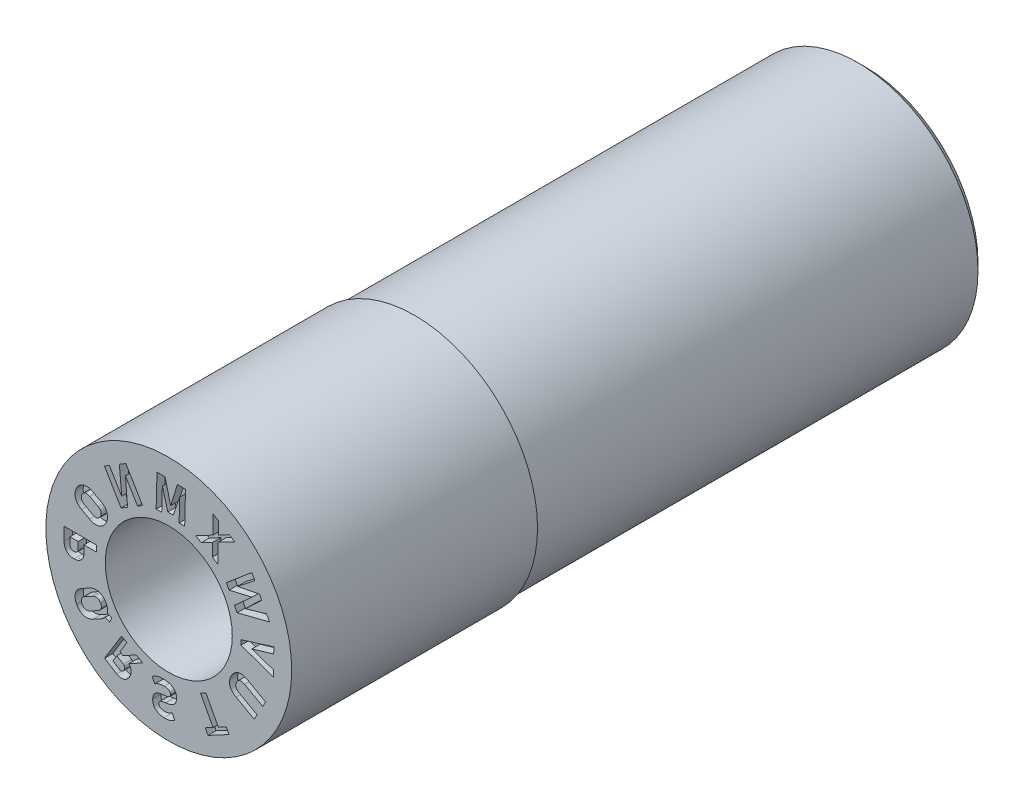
from build123d import *

# Parameters (mm, degrees)
SKETCH4_W          = 11
SKETCH4_H          = 1
CUT_EXTRUDE1_DEPTH = 0.2
CUT_EXTRUDE2_DEPTH = 1.4


with BuildPart() as part:
    # Sketch1 → Revolve1 (revolve)
    with BuildSketch(Plane(origin=(0, 0, 0), x_dir=(0, 0, -1), z_dir=(1, 0, 0)), mode=Mode.PRIVATE) as revolve1_sk:
        Polygon((0, 3), (0, 1.55), (2.8, 1.55), (2.8, 0.8), (14, 0.8), (14, 1.5), (17, 1.5), (17, 2.75), (16.75, 3), align=None)
    revolve(revolve1_sk.sketch.rotate(Axis((0, 0, 3.797909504), (0, 0, -1)), 90), axis=Axis((0, 0, 3.797909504), (0, 0, -1)))

    # Sketch4 → Cut-Revolve1 (revolve, cut)
    with BuildSketch(Plane(origin=(0, 0, 0), x_dir=(0, 0, -1), z_dir=(1, 0, 0)), mode=Mode.PRIVATE) as cut_revolve1_sk:
        with Locations((11.5, 3.435)):
            Rectangle(SKETCH4_W, SKETCH4_H)
    revolve(cut_revolve1_sk.sketch.rotate(Axis((0, 0, 0), (0, 0, -1)), 90), axis=Axis((0, 0, 0), (0, 0, -1)), mode=Mode.SUBTRACT)

    # Sketch2 → Cut-Extrude1 (cut)
    # profile 1 of 12: a face of its own
    with BuildSketch(Plane.XY):
        Polygon((2.269961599, 1.10939245), (2.215041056, 1.216013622), (1.675556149, 1.108706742), (2.099003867, 1.441434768), (2.028649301, 1.578164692), (1.407466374, 1.052778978), (1.471831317, 0.927682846), (2.028743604, 1.056310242), (1.603697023, 0.671870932), (1.668061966, 0.546774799), (2.456353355, 0.74724138), (2.385998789, 0.883971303), (1.869157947, 0.732459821), align=None)
    # profile 2 of 12: a face of its own
    with BuildSketch(Plane.XY):
        with BuildLine():
            Line((-2.068801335, 0.113277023), (-1.761023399, 0.112503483))
            Line((-1.761023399, 0.112503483), (-1.760614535, 0.262023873))
            Line((-1.760614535, 0.262023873), (-2.55380105, 0.264017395))
            Line((-2.55380105, 0.264017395), (-2.554571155, -0.054097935))
            add(Edge.make_bspline(
                [(-2.554571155, -0.054097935), (-2.554799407, -0.077504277), (-2.551376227, -0.111994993), (-2.5386526, -0.155381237), (-2.525537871, -0.184889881), (-2.508898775, -0.21170966), (-2.488986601, -0.235538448), (-2.465902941, -0.256095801), (-2.43977874, -0.273245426), (-2.411099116, -0.287077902), (-2.368647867, -0.300213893), (-2.33492501, -0.304167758), (-2.311979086, -0.303998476)],
                knots=[0, 0, 0, 0, 0.179096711, 0.263088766, 0.345010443, 0.425420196, 0.503810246, 0.581803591, 0.661047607, 0.742192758, 0.824607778, 1, 1, 1, 1], degree=3))
            add(Edge.make_bspline(
                [(-2.311979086, -0.303998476), (-2.289101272, -0.304083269), (-2.255348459, -0.300608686), (-2.213031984, -0.28744471), (-2.184417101, -0.273757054), (-2.158294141, -0.256842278), (-2.135270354, -0.23633847), (-2.115457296, -0.212606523), (-2.098753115, -0.185976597), (-2.085684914, -0.156582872), (-2.072494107, -0.113362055), (-2.069316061, -0.078782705), (-2.069154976, -0.055383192)],
                knots=[0, 0, 0, 0, 0.175511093, 0.257971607, 0.338737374, 0.418047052, 0.495878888, 0.574236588, 0.654395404, 0.736169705, 0.820238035, 1, 1, 1, 1], degree=3))
            Line((-2.069154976, -0.055383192), (-2.068801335, 0.113277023))
        make_face()
        with BuildLine():
            Line((-2.2128306, 0.113639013), (-2.213201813, -0.058724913))
            add(Edge.make_bspline(
                [(-2.213201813, -0.058724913), (-2.21323881, -0.067221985), (-2.214832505, -0.079706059), (-2.219846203, -0.095430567), (-2.225421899, -0.105948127), (-2.232025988, -0.115738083), (-2.240280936, -0.124222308), (-2.249625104, -0.131737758), (-2.260269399, -0.137923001), (-2.271804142, -0.143064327), (-2.288913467, -0.147749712), (-2.302348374, -0.149206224), (-2.311538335, -0.149143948)],
                knots=[0, 0, 0, 0, 0.169701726, 0.250141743, 0.328711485, 0.407036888, 0.485569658, 0.564515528, 0.646216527, 0.731138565, 0.816415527, 1, 1, 1, 1], degree=3))
            add(Edge.make_bspline(
                [(-2.311538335, -0.149143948), (-2.320849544, -0.149099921), (-2.334611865, -0.14788996), (-2.35187834, -0.142852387), (-2.363674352, -0.138004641), (-2.374343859, -0.131782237), (-2.383847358, -0.124354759), (-2.392016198, -0.115754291), (-2.398888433, -0.106050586), (-2.404099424, -0.09528711), (-2.409401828, -0.079493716), (-2.410521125, -0.066755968), (-2.410568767, -0.058191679)],
                knots=[0, 0, 0, 0, 0.184774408, 0.271287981, 0.355539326, 0.436837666, 0.515202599, 0.593720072, 0.671030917, 0.749801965, 0.829807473, 1, 1, 1, 1], degree=3))
            Line((-2.410568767, -0.058191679), (-2.410197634, 0.114135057))
            Line((-2.410197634, 0.114135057), (-2.2128306, 0.113639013))
        make_face(mode=Mode.SUBTRACT)
    # profile 3 of 12: a face of its own
    with BuildSketch(Plane.XY):
        Polygon((1.207581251, 1.806957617), (1.608315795, 2.016807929), (1.474297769, 2.099805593), (1.211357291, 1.962072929), (1.218694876, 2.257920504), (1.084315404, 2.340918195), (1.073431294, 1.889679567), (0.656387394, 1.671768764), (0.790766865, 1.588771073), (1.069684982, 1.734985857), (1.062055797, 1.420968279), (1.196290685, 1.337898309), align=None)
    # profile 4 of 12: a face of its own
    with BuildSketch(Plane.XY):
        with BuildLine():
            Line((-1.114677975, -1.753191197), (-1.191880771, -1.705847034))
            Line((-1.191880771, -1.705847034), (-1.024950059, -1.433715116))
            Line((-1.024950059, -1.433715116), (-1.152463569, -1.355543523))
            Line((-1.152463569, -1.355543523), (-1.56754191, -2.032207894))
            Line((-1.56754191, -2.032207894), (-1.27138768, -2.213917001))
            add(Edge.make_bspline(
                [(-1.27138768, -2.213917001), (-1.253710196, -2.224551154), (-1.225992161, -2.237968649), (-1.18683794, -2.247098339), (-1.157941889, -2.249889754), (-1.129355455, -2.248236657), (-1.101352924, -2.242568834), (-1.074305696, -2.232544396), (-1.048154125, -2.218737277), (-1.023356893, -2.201050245), (-0.991940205, -2.171714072), (-0.971931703, -2.145520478), (-0.960367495, -2.126408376)],
                knots=[0, 0, 0, 0, 0.170511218, 0.251263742, 0.330554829, 0.409169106, 0.48658696, 0.565366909, 0.646269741, 0.729870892, 0.815831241, 1, 1, 1, 1], degree=3))
            add(Edge.make_bspline(
                [(-0.960367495, -2.126408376), (-0.948791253, -2.107317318), (-0.933942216, -2.077749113), (-0.922389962, -2.036290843), (-0.917689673, -2.006139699), (-0.917313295, -1.976562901), (-0.920678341, -1.947843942), (-0.928492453, -1.920364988), (-0.940164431, -1.894130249), (-0.955174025, -1.870107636), (-0.967192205, -1.855661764), (-0.973414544, -1.849077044)],
                knots=[0, 0, 0, 0, 0.184350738, 0.270499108, 0.353948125, 0.4352156, 0.51362466, 0.591508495, 0.669792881, 0.749624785, 0.824262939, 0.824262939, 0.824262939, 0.824262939], degree=3))
            Line((-0.973414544, -1.849077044), (-0.640884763, -1.669450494))
            Line((-0.640884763, -1.669450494), (-0.795308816, -1.574654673))
            Line((-0.795308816, -1.574654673), (-1.114677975, -1.753191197))
        make_face()
        with BuildLine():
            Line((-1.267207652, -1.828645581), (-1.108791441, -1.925819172))
            add(Edge.make_bspline(
                [(-1.108791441, -1.925819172), (-1.102451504, -1.929449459), (-1.094054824, -1.936425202), (-1.08513243, -1.947600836), (-1.079953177, -1.956719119), (-1.076316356, -1.96647343), (-1.074040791, -1.976799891), (-1.073260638, -1.987657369), (-1.074149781, -1.999004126), (-1.076405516, -2.0105738), (-1.081390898, -2.026691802), (-1.087007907, -2.03836603), (-1.091580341, -2.045943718)],
                knots=[0, 0, 0, 0, 0.160363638, 0.237859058, 0.313886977, 0.390284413, 0.466266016, 0.546044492, 0.62907491, 0.716185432, 0.805143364, 1, 1, 1, 1], degree=3))
            add(Edge.make_bspline(
                [(-1.091580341, -2.045943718), (-1.096019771, -2.053479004), (-1.10378041, -2.063752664), (-1.11567825, -2.075588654), (-1.124936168, -2.082892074), (-1.13476272, -2.088498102), (-1.144651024, -2.092990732), (-1.154931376, -2.095476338), (-1.165274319, -2.096850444), (-1.175718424, -2.096219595), (-1.189915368, -2.093465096), (-1.199967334, -2.088756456), (-1.206308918, -2.084884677)],
                knots=[0, 0, 0, 0, 0.192245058, 0.281876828, 0.368857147, 0.450818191, 0.530411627, 0.606942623, 0.682725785, 0.75921083, 0.83607186, 1, 1, 1, 1], degree=3))
            Line((-1.206308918, -2.084884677), (-1.36476598, -1.987686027))
            Line((-1.36476598, -1.987686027), (-1.267207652, -1.828645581))
        make_face(mode=Mode.SUBTRACT)
    # profile 5 of 12: a face of its own
    with BuildSketch(Plane.XY):
        Polygon((-0.090645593, 2.53873645), (-0.28768482, 2.543906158), (-0.307976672, 1.750711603), (-0.172032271, 1.747243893), (-0.157578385, 2.310016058), (-0.023604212, 1.83182966), (0.108457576, 1.82840083), (0.266656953, 2.289668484), (0.252444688, 1.736303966), (0.388227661, 1.732844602), (0.408519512, 2.526039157), (0.211633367, 2.531039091), (0.046780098, 2.000408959), align=None)
    # profile 6 of 12: a face of its own
    with BuildSketch(Plane.XY):
        Polygon((1.08056531, -2.171597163), (0.889853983, -2.273408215), (0.95768341, -2.400516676), (1.470726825, -2.126628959), (1.402897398, -1.999520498), (1.212317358, -2.101261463), (0.906596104, -1.528426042), (0.774878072, -1.598825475), align=None)
    # profile 7 of 12: a face of its own
    with BuildSketch(Plane.XY):
        Polygon((-1.047955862, 2.342137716), (-1.205453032, 2.247994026), (-1.149521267, 1.602781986), (-1.448465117, 2.102888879), (-1.571666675, 2.029228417), (-1.163505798, 1.346324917), (-1.004980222, 1.441017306), (-1.057558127, 2.078702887), (-0.762920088, 1.585716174), (-0.639794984, 1.659234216), align=None)
    # profile 8 of 12: a face of its own
    with BuildSketch(Plane.XY):
        with BuildLine():
            Line((-1.653695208, 1.23468154), (-1.851264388, 1.343041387))
            add(Edge.make_bspline(
                [(-1.851264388, 1.343041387), (-1.863764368, 1.349704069), (-1.88253424, 1.359242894), (-1.908468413, 1.368762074), (-1.927521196, 1.374815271), (-1.946593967, 1.37945218), (-1.965628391, 1.382909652), (-1.984631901, 1.384749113), (-2.003520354, 1.385660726), (-2.022200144, 1.384827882), (-2.040593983, 1.383308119), (-2.058578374, 1.379968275), (-2.076215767, 1.375618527), (-2.093524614, 1.370015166), (-2.110347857, 1.362994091), (-2.12695135, 1.355014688), (-2.142978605, 1.345458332), (-2.158432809, 1.334764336), (-2.173463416, 1.323145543), (-2.187599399, 1.310190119), (-2.201132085, 1.296171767), (-2.213948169, 1.281043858), (-2.23031128, 1.25915329), (-2.241210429, 1.241488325), (-2.247934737, 1.229228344)],
                knots=[0, 0, 0, 0, 0.091509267, 0.135459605, 0.178154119, 0.220454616, 0.262041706, 0.302877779, 0.343583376, 0.383954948, 0.42345463, 0.462585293, 0.501839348, 0.540633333, 0.579850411, 0.619400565, 0.659411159, 0.700116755, 0.740631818, 0.781903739, 0.823734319, 0.866298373, 0.909761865, 1, 1, 1, 1], degree=3))
            add(Edge.make_bspline(
                [(-2.247934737, 1.229228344), (-2.254779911, 1.216989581), (-2.263710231, 1.198219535), (-2.273362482, 1.172634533), (-2.279121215, 1.153694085), (-2.283893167, 1.134844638), (-2.286878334, 1.115881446), (-2.288893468, 1.097001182), (-2.289497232, 1.078134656), (-2.288907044, 1.059471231), (-2.286737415, 1.04114284), (-2.283607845, 1.023203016), (-2.279119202, 1.005619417), (-2.273315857, 0.988419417), (-2.266151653, 0.971633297), (-2.258026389, 0.955054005), (-2.248222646, 0.93913159), (-2.237630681, 0.923455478), (-2.225487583, 0.908692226), (-2.212604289, 0.894251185), (-2.198259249, 0.880807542), (-2.183113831, 0.867731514), (-2.160828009, 0.851361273), (-2.14293173, 0.840362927), (-2.130515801, 0.833519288)],
                knots=[0, 0, 0, 0, 0.090427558, 0.133878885, 0.176295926, 0.218093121, 0.259200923, 0.300025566, 0.340521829, 0.380882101, 0.420369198, 0.459488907, 0.49829228, 0.537326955, 0.57647291, 0.615973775, 0.656310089, 0.697004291, 0.737925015, 0.779528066, 0.821766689, 0.864651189, 0.908550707, 1, 1, 1, 1], degree=3))
            Line((-2.130515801, 0.833519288), (-1.93294662, 0.725159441))
            add(Edge.make_bspline(
                [(-1.93294662, 0.725159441), (-1.9204413, 0.718514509), (-1.901687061, 0.708923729), (-1.875689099, 0.699473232), (-1.856700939, 0.693196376), (-1.837566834, 0.688783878), (-1.818510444, 0.685284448), (-1.799430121, 0.683372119), (-1.780491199, 0.682600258), (-1.761782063, 0.682929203), (-1.743412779, 0.684990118), (-1.725387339, 0.687975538), (-1.707714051, 0.692323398), (-1.690436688, 0.698008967), (-1.673531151, 0.70496292), (-1.657009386, 0.713217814), (-1.640911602, 0.722737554), (-1.62542025, 0.733477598), (-1.610387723, 0.745092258), (-1.596252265, 0.75804881), (-1.582719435, 0.772066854), (-1.569903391, 0.787194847), (-1.553540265, 0.809085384), (-1.542641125, 0.826750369), (-1.535916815, 0.839010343)],
                knots=[0, 0, 0, 0, 0.091418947, 0.135325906, 0.178244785, 0.220252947, 0.261798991, 0.30308282, 0.34374824, 0.383960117, 0.423573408, 0.462799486, 0.501685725, 0.540777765, 0.579956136, 0.619429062, 0.659747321, 0.700412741, 0.740887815, 0.782119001, 0.823908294, 0.866430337, 0.90985093, 1, 1, 1, 1], degree=3))
            add(Edge.make_bspline(
                [(-1.535916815, 0.839010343), (-1.529077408, 0.851250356), (-1.520130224, 0.870016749), (-1.510504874, 0.895607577), (-1.504684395, 0.91449499), (-1.500176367, 0.933398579), (-1.49688001, 0.95227427), (-1.49516187, 0.971190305), (-1.494441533, 0.989943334), (-1.495209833, 1.008550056), (-1.4971247, 1.026848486), (-1.500229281, 1.044867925), (-1.505115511, 1.06239099), (-1.510613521, 1.079732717), (-1.517801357, 1.096595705), (-1.526281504, 1.113036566), (-1.535723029, 1.129240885), (-1.546699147, 1.144648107), (-1.558489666, 1.159695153), (-1.571661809, 1.173889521), (-1.585934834, 1.187408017), (-1.601101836, 1.20046526), (-1.623379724, 1.216842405), (-1.641280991, 1.22783641), (-1.653695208, 1.23468154)],
                knots=[0, 0, 0, 0, 0.090417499, 0.133863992, 0.176276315, 0.217818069, 0.259154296, 0.299759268, 0.340251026, 0.380131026, 0.419767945, 0.458883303, 0.497905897, 0.537021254, 0.576162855, 0.615970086, 0.656312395, 0.697015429, 0.737894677, 0.779552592, 0.821786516, 0.864666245, 0.90856088, 1, 1, 1, 1], degree=3))
        make_face()
        with BuildLine():
            Line((-1.854781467, 0.859507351), (-2.059275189, 0.971499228))
            add(Edge.make_bspline(
                [(-2.059275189, 0.971499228), (-2.070822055, 0.977705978), (-2.086694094, 0.988826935), (-2.104826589, 1.006549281), (-2.115680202, 1.021049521), (-2.124660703, 1.036251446), (-2.130808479, 1.052445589), (-2.134815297, 1.069215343), (-2.136030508, 1.086575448), (-2.134943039, 1.10427525), (-2.130314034, 1.128599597), (-2.122553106, 1.14596887), (-2.116561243, 1.157219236)],
                knots=[0, 0, 0, 0, 0.179291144, 0.26398396, 0.346173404, 0.426702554, 0.505006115, 0.582502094, 0.662078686, 0.742384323, 0.824864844, 1, 1, 1, 1], degree=3))
            add(Edge.make_bspline(
                [(-2.116561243, 1.157219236), (-2.110462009, 1.168426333), (-2.099622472, 1.183926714), (-2.081883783, 1.201116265), (-2.067677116, 1.211629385), (-2.052275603, 1.219677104), (-2.036098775, 1.225449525), (-2.019063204, 1.228654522), (-2.001434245, 1.229540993), (-1.98336761, 1.228080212), (-1.958720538, 1.22221453), (-1.940731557, 1.215126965), (-1.929342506, 1.208557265)],
                knots=[0, 0, 0, 0, 0.175013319, 0.257188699, 0.337905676, 0.416521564, 0.494677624, 0.572623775, 0.653377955, 0.736149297, 0.820281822, 1, 1, 1, 1], degree=3))
            Line((-1.929342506, 1.208557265), (-1.724848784, 1.096565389))
            add(Edge.make_bspline(
                [(-1.724848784, 1.096565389), (-1.713294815, 1.090271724), (-1.697439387, 1.079148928), (-1.679255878, 1.06148279), (-1.66844602, 1.047012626), (-1.659463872, 1.031813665), (-1.653311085, 1.015619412), (-1.649342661, 0.998918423), (-1.648032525, 0.981644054), (-1.649096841, 0.963964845), (-1.654021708, 0.939713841), (-1.661383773, 0.922234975), (-1.667513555, 0.911068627)],
                knots=[0, 0, 0, 0, 0.180158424, 0.264225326, 0.346506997, 0.427126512, 0.50551794, 0.583100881, 0.661766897, 0.742162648, 0.825246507, 1, 1, 1, 1], degree=3))
            add(Edge.make_bspline(
                [(-1.667513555, 0.911068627), (-1.673918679, 0.900089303), (-1.684166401, 0.884071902), (-1.702251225, 0.867217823), (-1.716425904, 0.85660521), (-1.731895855, 0.848602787), (-1.748016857, 0.842560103), (-1.765066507, 0.839417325), (-1.782655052, 0.838552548), (-1.800731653, 0.839859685), (-1.825466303, 0.845495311), (-1.843375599, 0.852996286), (-1.854781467, 0.859507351)],
                knots=[0, 0, 0, 0, 0.17506645, 0.257026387, 0.337672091, 0.416954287, 0.4948771, 0.572754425, 0.6534373, 0.735689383, 0.820268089, 1, 1, 1, 1], degree=3))
        make_face(mode=Mode.SUBTRACT)
    # profile 9 of 12: a face of its own
    with BuildSketch(Plane.XY):
        with BuildLine():
            Line((-1.55203058, -1.159989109), (-1.442402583, -1.208864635))
            Line((-1.442402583, -1.208864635), (-1.391673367, -1.089487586))
            Line((-1.391673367, -1.089487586), (-1.49596757, -1.043145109))
            add(Edge.make_bspline(
                [(-1.49596757, -1.043145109), (-1.495153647, -1.039077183), (-1.493354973, -1.028940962), (-1.491858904, -1.012470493), (-1.491051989, -0.99378221), (-1.491767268, -0.974933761), (-1.493608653, -0.955982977), (-1.497042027, -0.937095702), (-1.501526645, -0.918114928), (-1.507319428, -0.899139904), (-1.517147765, -0.873555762), (-1.526216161, -0.854823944), (-1.532987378, -0.842518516)],
                knots=[0.55328784, 0.55328784, 0.55328784, 0.55328784, 0.579974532, 0.619519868, 0.659607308, 0.700291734, 0.740802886, 0.782043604, 0.823730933, 0.866270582, 0.90961669, 1, 1, 1, 1], degree=3))
            add(Edge.make_bspline(
                [(-1.532987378, -0.842518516), (-1.539570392, -0.830134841), (-1.550800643, -0.812645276), (-1.567018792, -0.790591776), (-1.579984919, -0.775562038), (-1.593565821, -0.761590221), (-1.607860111, -0.748726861), (-1.622846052, -0.736958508), (-1.638435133, -0.726342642), (-1.654582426, -0.716915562), (-1.671132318, -0.708710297), (-1.688081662, -0.70190745), (-1.705312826, -0.696117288), (-1.723038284, -0.69194558), (-1.741113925, -0.688601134), (-1.759610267, -0.687043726), (-1.778350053, -0.686458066), (-1.797307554, -0.686991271), (-1.816304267, -0.689367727), (-1.835437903, -0.692439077), (-1.854485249, -0.697371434), (-1.873608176, -0.703297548), (-1.899528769, -0.713054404), (-1.918265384, -0.722694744), (-1.930830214, -0.729296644)],
                knots=[0, 0, 0, 0, 0.090195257, 0.133684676, 0.176153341, 0.217890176, 0.259069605, 0.299873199, 0.340487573, 0.3804085, 0.420176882, 0.459306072, 0.497927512, 0.537093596, 0.576457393, 0.616177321, 0.656458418, 0.697161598, 0.738122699, 0.779639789, 0.821845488, 0.864668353, 0.908520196, 1, 1, 1, 1], degree=3))
            Line((-1.930830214, -0.729296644), (-2.128642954, -0.83818309))
            add(Edge.make_bspline(
                [(-2.128642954, -0.83818309), (-2.140948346, -0.845241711), (-2.159035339, -0.856007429), (-2.181172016, -0.87264176), (-2.19641723, -0.885640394), (-2.210796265, -0.899101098), (-2.223845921, -0.913501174), (-2.235815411, -0.928482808), (-2.246625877, -0.944075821), (-2.256230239, -0.960176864), (-2.264574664, -0.976695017), (-2.271615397, -0.993595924), (-2.277275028, -1.010871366), (-2.281994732, -1.028480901), (-2.285076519, -1.046524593), (-2.287078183, -1.064886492), (-2.28784204, -1.083521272), (-2.286952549, -1.102354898), (-2.285304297, -1.121319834), (-2.281867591, -1.14021956), (-2.277210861, -1.159117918), (-2.271477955, -1.178069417), (-2.261631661, -1.203649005), (-2.252574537, -1.222383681), (-2.245799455, -1.234688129)],
                knots=[0, 0, 0, 0, 0.091421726, 0.135239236, 0.178146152, 0.220390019, 0.261974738, 0.303163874, 0.343795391, 0.384056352, 0.42379364, 0.462866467, 0.501828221, 0.54078225, 0.580149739, 0.619563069, 0.659672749, 0.700093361, 0.740900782, 0.782164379, 0.823633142, 0.866196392, 0.909566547, 1, 1, 1, 1], degree=3))
            add(Edge.make_bspline(
                [(-2.245799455, -1.234688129), (-2.239226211, -1.247080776), (-2.227967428, -1.26454414), (-2.211764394, -1.286681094), (-2.198661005, -1.301601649), (-2.185332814, -1.315832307), (-2.170998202, -1.328601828), (-2.15603219, -1.34039119), (-2.140387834, -1.351020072), (-2.124260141, -1.36049024), (-2.107670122, -1.368573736), (-2.090848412, -1.375715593), (-2.073466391, -1.381156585), (-2.055829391, -1.385777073), (-2.037731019, -1.388594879), (-2.019335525, -1.390513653), (-2.000604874, -1.391013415), (-1.981617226, -1.390442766), (-1.962586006, -1.388295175), (-1.943464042, -1.384935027), (-1.9243608, -1.380260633), (-1.905218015, -1.374253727), (-1.879291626, -1.364522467), (-1.860558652, -1.354866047), (-1.847992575, -1.348269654)],
                knots=[0, 0, 0, 0, 0.090173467, 0.13365238, 0.176442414, 0.21791468, 0.259084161, 0.299877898, 0.340482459, 0.38074038, 0.420154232, 0.459213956, 0.498247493, 0.537294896, 0.57646227, 0.616016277, 0.656287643, 0.69698099, 0.738203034, 0.779452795, 0.821888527, 0.864701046, 0.908542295, 1, 1, 1, 1], degree=3))
            Line((-1.847992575, -1.348269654), (-1.650179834, -1.239383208))
            add(Edge.make_bspline(
                [(-1.650179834, -1.239383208), (-1.637873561, -1.232326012), (-1.619789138, -1.221556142), (-1.59760721, -1.204897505), (-1.582386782, -1.191886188), (-1.568144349, -1.178304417), (-1.558299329, -1.167491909), (-1.553085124, -1.161269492), (-1.55203058, -1.159989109)],
                knots=[0, 0, 0, 0, 0.091371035, 0.135164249, 0.178378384, 0.220178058, 0.26173972, 0.272413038, 0.272413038, 0.272413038, 0.272413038], degree=3))
        make_face()
        with BuildLine():
            Line((-1.721718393, -1.101099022), (-1.926436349, -1.213654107))
            add(Edge.make_bspline(
                [(-1.926436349, -1.213654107), (-1.937930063, -1.219884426), (-1.955748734, -1.227777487), (-1.980575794, -1.23317694), (-1.998660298, -1.234920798), (-2.016310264, -1.233859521), (-2.033381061, -1.230780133), (-2.049590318, -1.224818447), (-2.065086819, -1.216881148), (-2.079380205, -1.206393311), (-2.097330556, -1.189285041), (-2.108018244, -1.173532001), (-2.114262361, -1.162329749)],
                knots=[0, 0, 0, 0, 0.179093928, 0.264008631, 0.346524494, 0.426667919, 0.505058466, 0.582809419, 0.661916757, 0.742384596, 0.824306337, 1, 1, 1, 1], degree=3))
            add(Edge.make_bspline(
                [(-2.114262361, -1.162329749), (-2.120244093, -1.151083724), (-2.127925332, -1.133708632), (-2.132691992, -1.109436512), (-2.133932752, -1.091759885), (-2.132565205, -1.074390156), (-2.128687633, -1.057570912), (-2.12234952, -1.041412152), (-2.113577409, -1.026099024), (-2.102557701, -1.011712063), (-2.084584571, -0.993816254), (-2.06871592, -0.982603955), (-2.057104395, -0.976467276)],
                knots=[0, 0, 0, 0, 0.174878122, 0.257325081, 0.33759804, 0.416795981, 0.494956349, 0.573085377, 0.653581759, 0.735800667, 0.820459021, 1, 1, 1, 1], degree=3))
            Line((-2.057104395, -0.976467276), (-1.852386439, -0.863912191))
            add(Edge.make_bspline(
                [(-1.852386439, -0.863912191), (-1.840913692, -0.857482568), (-1.823040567, -0.849832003), (-1.798303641, -0.844064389), (-1.780237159, -0.842668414), (-1.76258612, -0.84341216), (-1.745499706, -0.846593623), (-1.729259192, -0.852467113), (-1.713899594, -0.86065766), (-1.699562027, -0.87106421), (-1.681736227, -0.888202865), (-1.670757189, -0.903629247), (-1.664747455, -0.914927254)],
                knots=[0, 0, 0, 0, 0.179889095, 0.264360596, 0.346508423, 0.427089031, 0.505553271, 0.583377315, 0.662500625, 0.743044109, 0.825042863, 1, 1, 1, 1], degree=3))
            add(Edge.make_bspline(
                [(-1.664747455, -0.914927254), (-1.658639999, -0.926220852), (-1.651204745, -0.943687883), (-1.646095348, -0.967977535), (-1.645065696, -0.985681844), (-1.646394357, -1.003034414), (-1.650189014, -1.019822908), (-1.656516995, -1.035938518), (-1.665337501, -1.051206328), (-1.676134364, -1.065756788), (-1.694218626, -1.08362502), (-1.710092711, -1.094877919), (-1.721718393, -1.101099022)],
                knots=[0, 0, 0, 0, 0.175738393, 0.257569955, 0.33835946, 0.417477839, 0.494864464, 0.572915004, 0.65333052, 0.735403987, 0.819977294, 1, 1, 1, 1], degree=3))
        make_face(mode=Mode.SUBTRACT)
    # profile 10 of 12: a face of its own
    with BuildSketch(Plane.XY):
        with BuildLine():
            Line((-0.403028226, -1.833225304), (-0.340738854, -1.960407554))
            add(Edge.make_bspline(
                [(-0.340738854, -1.960407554), (-0.324717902, -1.948574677), (-0.298744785, -1.933114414), (-0.261337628, -1.917371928), (-0.231631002, -1.907912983), (-0.201038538, -1.900777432), (-0.159605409, -1.894266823), (-0.128085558, -1.893962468), (-0.107188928, -1.895010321)],
                knots=[0, 0, 0, 0, 0.241526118, 0.365036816, 0.491760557, 0.61934319, 0.74589648, 1, 1, 1, 1], degree=3))
            add(Edge.make_bspline(
                [(-0.107188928, -1.895010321), (-0.095699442, -1.895882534), (-0.078884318, -1.897158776), (-0.057403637, -1.901122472), (-0.042805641, -1.904661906), (-0.029205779, -1.908835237), (-0.016822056, -1.913994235), (-0.005355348, -1.919607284), (0.004862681, -1.926058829), (0.014016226, -1.933086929), (0.021779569, -1.94083183), (0.028486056, -1.948961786), (0.033557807, -1.957914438), (0.037688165, -1.96721945), (0.040961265, -1.980865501), (0.041650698, -1.991471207), (0.041272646, -1.998652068)],
                knots=[0, 0, 0, 0, 0.170676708, 0.249019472, 0.323000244, 0.392902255, 0.459277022, 0.521339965, 0.581609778, 0.637818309, 0.6917406, 0.743613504, 0.793211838, 0.843554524, 0.893764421, 1, 1, 1, 1], degree=3))
            add(Edge.make_bspline(
                [(0.041272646, -1.998652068), (0.040786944, -2.008753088), (0.037919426, -2.022718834), (0.029211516, -2.038936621), (0.020553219, -2.04872868), (0.010303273, -2.056865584), (-0.001373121, -2.063569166), (-0.01416112, -2.069206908), (-0.028465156, -2.073304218), (-0.044385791, -2.076530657), (-0.069358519, -2.080818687), (-0.089235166, -2.08316724), (-0.103125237, -2.084417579)],
                knots=[0, 0, 0, 0, 0.155620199, 0.226283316, 0.295120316, 0.365309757, 0.43688435, 0.512160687, 0.590593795, 0.67677816, 0.774613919, 1, 1, 1, 1], degree=3))
            add(Edge.make_bspline(
                [(-0.103125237, -2.084417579), (-0.104116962, -2.084971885), (-0.10625322, -2.084866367), (-0.108370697, -2.084839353), (-0.109389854, -2.085192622)],
                knots=[0, 0, 0, 0, 0.504196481, 1, 1, 1, 1], degree=3))
            Line((-0.109389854, -2.085192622), (-0.121366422, -2.08615298))
            add(Edge.make_bspline(
                [(-0.121366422, -2.08615298), (-0.14596909, -2.088835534), (-0.18138866, -2.092937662), (-0.225823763, -2.102295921), (-0.254771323, -2.109471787), (-0.281338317, -2.119153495), (-0.305602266, -2.132795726), (-0.327977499, -2.150142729), (-0.345015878, -2.167224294), (-0.357407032, -2.182854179), (-0.365664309, -2.196129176), (-0.372805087, -2.210711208), (-0.378748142, -2.22662801), (-0.38367738, -2.243812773), (-0.389166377, -2.269130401), (-0.391108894, -2.289013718), (-0.392008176, -2.302610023)],
                knots=[0, 0, 0, 0, 0.190653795, 0.273940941, 0.349427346, 0.420097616, 0.490876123, 0.562743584, 0.637428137, 0.675984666, 0.716053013, 0.75751184, 0.80076774, 0.846657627, 0.895025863, 1, 1, 1, 1], degree=3))
            add(Edge.make_bspline(
                [(-0.392008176, -2.302610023), (-0.392827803, -2.315639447), (-0.393039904, -2.334018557), (-0.390432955, -2.357957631), (-0.387885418, -2.375033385), (-0.383982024, -2.391456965), (-0.37880274, -2.407193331), (-0.372709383, -2.42235769), (-0.365467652, -2.436833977), (-0.35729192, -2.450693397), (-0.347632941, -2.46354187), (-0.337450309, -2.475951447), (-0.32592883, -2.487372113), (-0.313562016, -2.498131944), (-0.300061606, -2.508100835), (-0.285586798, -2.51733602), (-0.27013012, -2.525854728), (-0.253696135, -2.533526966), (-0.236319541, -2.540239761), (-0.218146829, -2.54641648), (-0.198937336, -2.551307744), (-0.17892331, -2.55570258), (-0.150447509, -2.560241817), (-0.128569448, -2.562673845), (-0.113639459, -2.563306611)],
                knots=[0, 0, 0, 0, 0.086192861, 0.127121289, 0.167037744, 0.205953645, 0.244114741, 0.281929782, 0.319274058, 0.356372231, 0.393427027, 0.430720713, 0.467690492, 0.505864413, 0.544412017, 0.584048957, 0.624955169, 0.666819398, 0.709819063, 0.754195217, 0.799943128, 0.847313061, 0.896372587, 1, 1, 1, 1], degree=3))
            add(Edge.make_bspline(
                [(-0.113639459, -2.563306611), (-0.099289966, -2.564029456), (-0.077478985, -2.564106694), (-0.048230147, -2.561721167), (-0.018320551, -2.557621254), (0.019013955, -2.549538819), (0.077665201, -2.531121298), (0.119394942, -2.510800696), (0.14577231, -2.494897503)],
                knots=[0, 0, 0, 0, 0.158393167, 0.240052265, 0.323317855, 0.491049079, 0.660455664, 1, 1, 1, 1], degree=3))
            Line((0.14577231, -2.494897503), (0.089834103, -2.364673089))
            add(Edge.make_bspline(
                [(0.089834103, -2.364673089), (0.074232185, -2.37415718), (0.050090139, -2.386821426), (0.016707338, -2.400424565), (-0.008342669, -2.408768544), (-0.033348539, -2.414899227), (-0.065554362, -2.420460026), (-0.08968757, -2.42138191), (-0.10542002, -2.420456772)],
                knots=[0, 0, 0, 0, 0.265832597, 0.396075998, 0.524577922, 0.649927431, 0.77063112, 1, 1, 1, 1], degree=3))
            add(Edge.make_bspline(
                [(-0.10542002, -2.420456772), (-0.116209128, -2.419648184), (-0.132018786, -2.418523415), (-0.152140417, -2.414646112), (-0.16578779, -2.411387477), (-0.178440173, -2.407624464), (-0.190060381, -2.403065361), (-0.20073441, -2.397887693), (-0.210324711, -2.391905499), (-0.218934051, -2.385548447), (-0.226201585, -2.378424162), (-0.232470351, -2.37098968), (-0.237262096, -2.362871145), (-0.241034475, -2.354364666), (-0.244237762, -2.342037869), (-0.244879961, -2.33233932), (-0.244463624, -2.32581832)],
                knots=[0, 0, 0, 0, 0.1728733, 0.252208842, 0.326759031, 0.39674636, 0.462658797, 0.525763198, 0.585762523, 0.642831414, 0.696149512, 0.747834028, 0.797534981, 0.84606173, 0.895881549, 1, 1, 1, 1], degree=3))
            add(Edge.make_bspline(
                [(-0.244463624, -2.32581832), (-0.244015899, -2.314929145), (-0.241219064, -2.299731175), (-0.231569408, -2.282278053), (-0.222054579, -2.271918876), (-0.211076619, -2.263218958), (-0.198958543, -2.255856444), (-0.185721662, -2.249992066), (-0.171083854, -2.245479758), (-0.154469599, -2.241889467), (-0.127126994, -2.236044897), (-0.104816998, -2.233448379), (-0.089134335, -2.230846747)],
                knots=[0, 0, 0, 0, 0.156302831, 0.226415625, 0.295800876, 0.365382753, 0.435560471, 0.507496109, 0.581530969, 0.664436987, 0.761877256, 1, 1, 1, 1], degree=3))
            add(Edge.make_bspline(
                [(-0.089134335, -2.230846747), (-0.087693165, -2.230300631), (-0.084663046, -2.230593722), (-0.081707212, -2.229947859), (-0.080228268, -2.229711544)],
                knots=[0, 0, 0, 0, 0.498577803, 1, 1, 1, 1], degree=3))
            add(Edge.make_bspline(
                [(-0.080228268, -2.229711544), (-0.0781446, -2.229339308), (-0.073847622, -2.228950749), (-0.069679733, -2.227815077), (-0.067485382, -2.22769709)],
                knots=[0, 0, 0, 0, 0.492192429, 1, 1, 1, 1], degree=3))
            add(Edge.make_bspline(
                [(-0.067485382, -2.22769709), (-0.044057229, -2.224468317), (-0.010423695, -2.218586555), (0.03199532, -2.208119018), (0.059885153, -2.199795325), (0.085321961, -2.189023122), (0.108514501, -2.174867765), (0.129686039, -2.157326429), (0.145690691, -2.140213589), (0.157151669, -2.124751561), (0.164727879, -2.111761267), (0.171544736, -2.097758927), (0.176983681, -2.082462), (0.181816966, -2.066235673), (0.186454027, -2.042347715), (0.188711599, -2.023796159), (0.189357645, -2.011024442)],
                knots=[0, 0, 0, 0, 0.189440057, 0.273134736, 0.349860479, 0.422336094, 0.493720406, 0.566657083, 0.641919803, 0.680780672, 0.720567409, 0.762195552, 0.805317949, 0.850441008, 0.897677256, 1, 1, 1, 1], degree=3))
            Line((0.189357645, -2.011024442), (0.189320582, -2.009882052))
            add(Edge.make_bspline(
                [(0.189320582, -2.009882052), (0.190075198, -1.997705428), (0.190170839, -1.979600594), (0.187625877, -1.955959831), (0.184879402, -1.939085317), (0.18073128, -1.922874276), (0.175397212, -1.90733019), (0.16914839, -1.892262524), (0.161548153, -1.877944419), (0.152962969, -1.86421626), (0.143174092, -1.851329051), (0.132320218, -1.839187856), (0.12070444, -1.827586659), (0.107634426, -1.817065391), (0.093733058, -1.807084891), (0.078675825, -1.797943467), (0.062647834, -1.789534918), (0.045679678, -1.78175751), (0.027612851, -1.7751558), (0.008735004, -1.76918834), (-0.011006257, -1.763835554), (-0.03180036, -1.759733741), (-0.061142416, -1.754893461), (-0.083779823, -1.752850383), (-0.099112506, -1.751982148)],
                knots=[0, 0, 0, 0, 0.083524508, 0.123521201, 0.162624, 0.200430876, 0.237878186, 0.275019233, 0.311939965, 0.348681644, 0.385721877, 0.422531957, 0.460080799, 0.497923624, 0.537213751, 0.577133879, 0.618356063, 0.661035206, 0.704768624, 0.74989454, 0.796517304, 0.844658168, 0.894874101, 1, 1, 1, 1], degree=3))
            add(Edge.make_bspline(
                [(-0.099112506, -1.751982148), (-0.11783353, -1.750690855), (-0.145877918, -1.750792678), (-0.183063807, -1.753389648), (-0.210522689, -1.756889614), (-0.237544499, -1.761713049), (-0.263960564, -1.767829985), (-0.289544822, -1.775722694), (-0.314411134, -1.784590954), (-0.338327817, -1.79486138), (-0.368574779, -1.809833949), (-0.389584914, -1.823638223), (-0.403028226, -1.833225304)],
                knots=[0, 0, 0, 0, 0.175415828, 0.262020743, 0.34857724, 0.43422492, 0.518718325, 0.602044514, 0.684549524, 0.765575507, 0.84540745, 1, 1, 1, 1], degree=3))
        make_face()
    # profile 11 of 12: a face of its own
    with BuildSketch(Plane.XY):
        with BuildLine():
            Line((1.642716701, -1.249113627), (2.083304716, -1.495551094))
            Line((2.083304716, -1.495551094), (2.156082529, -1.365449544))
            Line((2.156082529, -1.365449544), (1.712286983, -1.117188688))
            add(Edge.make_bspline(
                [(1.712286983, -1.117188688), (1.702844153, -1.111980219), (1.689643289, -1.10334067), (1.673897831, -1.090215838), (1.66374509, -1.080082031), (1.655284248, -1.069169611), (1.647824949, -1.05798271), (1.642179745, -1.046071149), (1.637599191, -1.033841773), (1.634603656, -1.021160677), (1.633129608, -1.008216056), (1.633065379, -0.995003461), (1.634536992, -0.981598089), (1.637474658, -0.967933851), (1.643463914, -0.948889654), (1.650282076, -0.935088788), (1.655252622, -0.925894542)],
                knots=[0, 0, 0, 0, 0.14249796, 0.207800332, 0.270673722, 0.331618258, 0.390026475, 0.447985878, 0.50538264, 0.562353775, 0.619697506, 0.677217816, 0.736611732, 0.797556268, 0.861663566, 1, 1, 1, 1], degree=3))
            add(Edge.make_bspline(
                [(1.655252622, -0.925894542), (1.660429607, -0.916737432), (1.668652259, -0.903536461), (1.682043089, -0.88845715), (1.692057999, -0.878502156), (1.702873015, -0.870186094), (1.714167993, -0.863204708), (1.726075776, -0.85762571), (1.738453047, -0.853405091), (1.751295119, -0.850676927), (1.764482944, -0.849461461), (1.777939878, -0.849749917), (1.791686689, -0.851550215), (1.805680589, -0.85459177), (1.825129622, -0.861219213), (1.839466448, -0.867742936), (1.848810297, -0.873160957)],
                knots=[0, 0, 0, 0, 0.138602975, 0.203136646, 0.264839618, 0.323984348, 0.382075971, 0.439108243, 0.496508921, 0.553646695, 0.61130908, 0.670262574, 0.730228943, 0.793355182, 0.858210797, 1, 1, 1, 1], degree=3))
            Line((1.848810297, -0.873160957), (2.292605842, -1.121421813))
            Line((2.292605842, -1.121421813), (2.365383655, -0.991320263))
            Line((2.365383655, -0.991320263), (1.92479564, -0.744882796))
            add(Edge.make_bspline(
                [(1.92479564, -0.744882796), (1.91172142, -0.737553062), (1.891954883, -0.727670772), (1.865145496, -0.716658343), (1.845516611, -0.710217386), (1.826222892, -0.704633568), (1.807061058, -0.700677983), (1.788108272, -0.698073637), (1.769429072, -0.696554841), (1.751040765, -0.696708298), (1.733044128, -0.698035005), (1.715395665, -0.700670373), (1.698109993, -0.704611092), (1.681260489, -0.710071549), (1.66481366, -0.716739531), (1.648738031, -0.724738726), (1.632989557, -0.733993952), (1.617821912, -0.744700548), (1.603157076, -0.756609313), (1.588915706, -0.769682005), (1.575399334, -0.784180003), (1.562091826, -0.799625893), (1.545510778, -0.822783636), (1.533620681, -0.84095948), (1.526601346, -0.853933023)],
                knots=[0, 0, 0, 0, 0.095751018, 0.141060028, 0.185052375, 0.227688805, 0.26933519, 0.309933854, 0.349876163, 0.38896359, 0.427303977, 0.465096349, 0.502874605, 0.54044995, 0.578144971, 0.616171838, 0.655081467, 0.694746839, 0.734674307, 0.775725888, 0.818150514, 0.861263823, 0.905888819, 1, 1, 1, 1], degree=3))
            add(Edge.make_bspline(
                [(1.526601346, -0.853933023), (1.519378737, -0.866707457), (1.509716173, -0.886106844), (1.499022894, -0.912447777), (1.49266887, -0.931738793), (1.487651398, -0.950828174), (1.483815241, -0.969656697), (1.481328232, -0.988316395), (1.480347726, -1.006772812), (1.480710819, -1.024955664), (1.482330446, -1.042785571), (1.485244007, -1.060263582), (1.489460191, -1.077437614), (1.495273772, -1.094145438), (1.502243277, -1.110525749), (1.510580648, -1.126523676), (1.520212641, -1.14215766), (1.531077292, -1.157428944), (1.543361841, -1.172051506), (1.556859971, -1.186243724), (1.571561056, -1.19995002), (1.587469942, -1.213205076), (1.610903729, -1.230202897), (1.629696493, -1.24177998), (1.642716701, -1.249113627)],
                knots=[0, 0, 0, 0, 0.093937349, 0.138578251, 0.181909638, 0.223877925, 0.264885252, 0.304862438, 0.344288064, 0.383100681, 0.42120778, 0.458811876, 0.49645235, 0.534282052, 0.571946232, 0.610338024, 0.649665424, 0.689433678, 0.730219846, 0.771830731, 0.814764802, 0.858838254, 0.904322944, 1, 1, 1, 1], degree=3))
        make_face()
    # profile 12 of 12: a face of its own
    with BuildSketch(Plane.XY):
        Polygon((2.551589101, -0.369978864), (2.554621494, -0.216090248), (2.029016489, -0.037110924), (2.561392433, 0.120939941), (2.564424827, 0.274828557), (1.765975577, 0.026665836), (1.763642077, -0.090204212), align=None)
    extrude(amount=-CUT_EXTRUDE1_DEPTH, mode=Mode.SUBTRACT)

    # Sketch3 → Cut-Extrude2 (cut)
    with BuildSketch(Plane.XY.offset(-2.8)):
        Polygon((0.461880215, 0.8), (-0.461880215, 0.8), (-0.923760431, 0), (-0.461880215, -0.8), (0.461880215, -0.8), (0.923760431, 0), align=None)
    extrude(amount=-CUT_EXTRUDE2_DEPTH, mode=Mode.SUBTRACT)


solid = part.part
